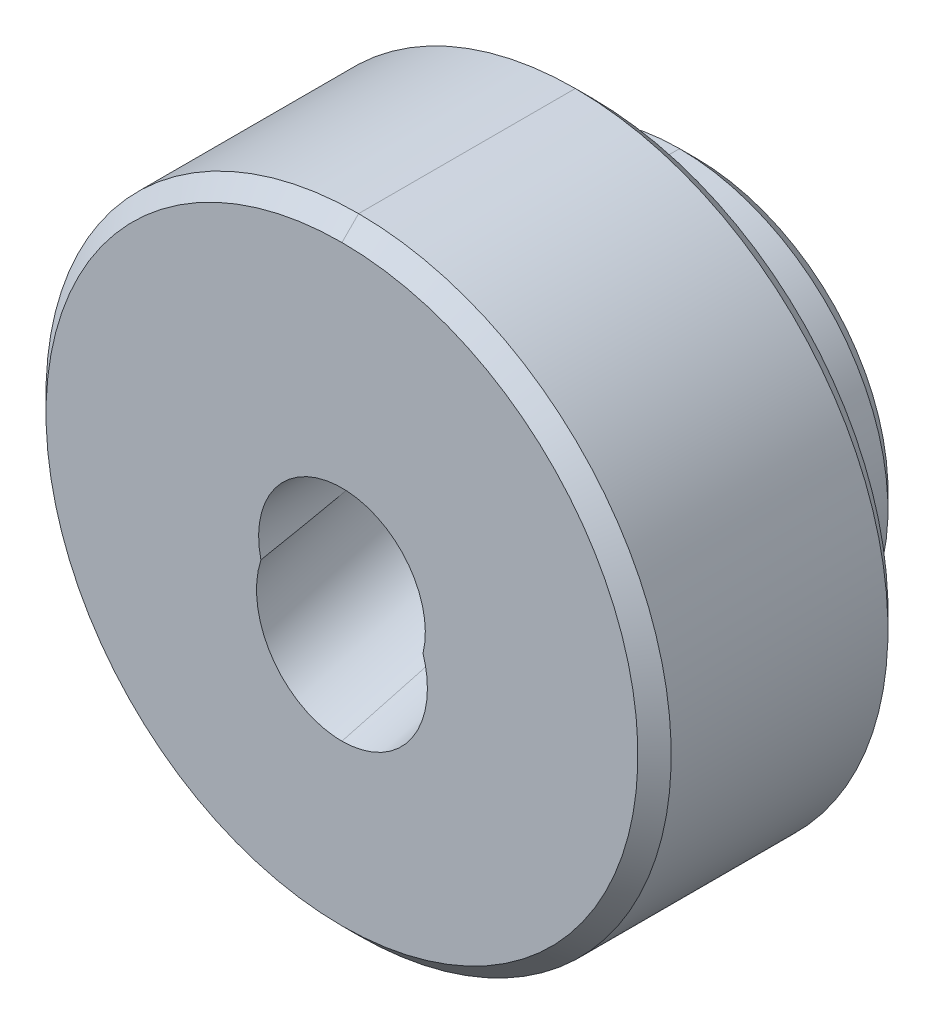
ISO-10303-21;
HEADER;
FILE_DESCRIPTION(('STEP AP214'),'2;1');
FILE_NAME('part.step','',(''),(''),'','','');
FILE_SCHEMA(('AUTOMOTIVE_DESIGN { 1 0 10303 214 1 1 1 1 }'));
ENDSEC;
DATA;
#1=APPLICATION_CONTEXT('core data for automotive mechanical design processes');
#2=APPLICATION_PROTOCOL_DEFINITION('international standard','automotive_design',2000,#1);
#3=PRODUCT_CONTEXT('',#1,'mechanical');
#4=PRODUCT('Part','Part','',(#3));
#5=PRODUCT_RELATED_PRODUCT_CATEGORY('part','',(#4));
#6=PRODUCT_DEFINITION_FORMATION('','',#4);
#7=PRODUCT_DEFINITION_CONTEXT('part definition',#1,'design');
#8=PRODUCT_DEFINITION('design','',#6,#7);
#9=PRODUCT_DEFINITION_SHAPE('','',#8);
#10=(LENGTH_UNIT() NAMED_UNIT(*) SI_UNIT(.MILLI.,.METRE.));
#11=(NAMED_UNIT(*) PLANE_ANGLE_UNIT() SI_UNIT($,.RADIAN.));
#12=(NAMED_UNIT(*) SI_UNIT($,.STERADIAN.) SOLID_ANGLE_UNIT());
#13=UNCERTAINTY_MEASURE_WITH_UNIT(LENGTH_MEASURE(1.E-05),#10,'distance_accuracy_value','');
#14=(GEOMETRIC_REPRESENTATION_CONTEXT(3) GLOBAL_UNCERTAINTY_ASSIGNED_CONTEXT((#13)) GLOBAL_UNIT_ASSIGNED_CONTEXT((#10,
#11,#12)) REPRESENTATION_CONTEXT('',''));
#15=CARTESIAN_POINT('',(0.,0.,0.));
#16=DIRECTION('',(0.,0.,1.));
#17=DIRECTION('',(1.,0.,0.));
#18=AXIS2_PLACEMENT_3D('',#15,#16,#17);
#19=CARTESIAN_POINT('',(0.,0.,4.2));
#20=DIRECTION('',(0.,0.,1.));
#21=DIRECTION('',(1.,0.,0.));
#22=AXIS2_PLACEMENT_3D('',#19,#20,#21);
#23=CYLINDRICAL_SURFACE('',#22,10.);
#24=CARTESIAN_POINT('',(0.,0.,4.2));
#25=DIRECTION('',(0.,0.,1.));
#26=DIRECTION('',(1.,0.,0.));
#27=AXIS2_PLACEMENT_3D('',#24,#25,#26);
#28=CIRCLE('',#27,10.);
#29=CARTESIAN_POINT('',(-10.,0.,4.2));
#30=VERTEX_POINT('',#29);
#31=CARTESIAN_POINT('',(0.,-10.,4.2));
#32=VERTEX_POINT('',#31);
#33=EDGE_CURVE('E409',#30,#32,#28,.T.);
#34=ORIENTED_EDGE('',*,*,#33,.F.);
#35=CARTESIAN_POINT('',(0.,0.,4.2));
#36=DIRECTION('',(0.,0.,1.));
#37=DIRECTION('',(1.,0.,0.));
#38=AXIS2_PLACEMENT_3D('',#35,#36,#37);
#39=CIRCLE('',#38,10.);
#40=CARTESIAN_POINT('',(0.,10.,4.2));
#41=VERTEX_POINT('',#40);
#42=EDGE_CURVE('E278',#41,#30,#39,.T.);
#43=ORIENTED_EDGE('',*,*,#42,.F.);
#44=DIRECTION('',(0.,0.,1.));
#45=VECTOR('',#44,1.);
#46=CARTESIAN_POINT('',(0.,10.,2.5));
#47=LINE('',#46,#45);
#48=CARTESIAN_POINT('',(0.,10.,0.8));
#49=VERTEX_POINT('',#48);
#50=EDGE_CURVE('E115',#49,#41,#47,.T.);
#51=ORIENTED_EDGE('',*,*,#50,.F.);
#52=CARTESIAN_POINT('',(0.,0.,0.8));
#53=DIRECTION('',(0.,0.,-1.));
#54=DIRECTION('',(0.,1.,0.));
#55=AXIS2_PLACEMENT_3D('',#52,#53,#54);
#56=CIRCLE('',#55,10.);
#57=CARTESIAN_POINT('',(0.,-10.,0.8));
#58=VERTEX_POINT('',#57);
#59=EDGE_CURVE('E184',#58,#49,#56,.T.);
#60=ORIENTED_EDGE('',*,*,#59,.F.);
#61=DIRECTION('',(0.,0.,-1.));
#62=VECTOR('',#61,1.);
#63=CARTESIAN_POINT('',(0.,-10.,2.5));
#64=LINE('',#63,#62);
#65=EDGE_CURVE('E411',#32,#58,#64,.T.);
#66=ORIENTED_EDGE('',*,*,#65,.F.);
#67=EDGE_LOOP('',(#34,#43,#51,#60,#66));
#68=FACE_BOUND('',#67,.T.);
#69=ADVANCED_FACE('F14',(#68),#23,.T.);
#70=CARTESIAN_POINT('',(0.,0.,4.2));
#71=DIRECTION('',(0.,0.,1.));
#72=DIRECTION('',(1.,0.,0.));
#73=AXIS2_PLACEMENT_3D('',#70,#71,#72);
#74=CYLINDRICAL_SURFACE('',#73,10.);
#75=ORIENTED_EDGE('',*,*,#65,.T.);
#76=CARTESIAN_POINT('',(0.,0.,0.8));
#77=DIRECTION('',(0.,0.,-1.));
#78=DIRECTION('',(0.,1.,0.));
#79=AXIS2_PLACEMENT_3D('',#76,#77,#78);
#80=CIRCLE('',#79,10.);
#81=EDGE_CURVE('E168',#49,#58,#80,.T.);
#82=ORIENTED_EDGE('',*,*,#81,.F.);
#83=ORIENTED_EDGE('',*,*,#50,.T.);
#84=CARTESIAN_POINT('',(0.,0.,4.2));
#85=DIRECTION('',(0.,0.,1.));
#86=DIRECTION('',(1.,0.,0.));
#87=AXIS2_PLACEMENT_3D('',#84,#85,#86);
#88=CIRCLE('',#87,10.);
#89=CARTESIAN_POINT('',(10.,0.,4.2));
#90=VERTEX_POINT('',#89);
#91=EDGE_CURVE('E276',#90,#41,#88,.T.);
#92=ORIENTED_EDGE('',*,*,#91,.F.);
#93=CARTESIAN_POINT('',(0.,0.,4.2));
#94=DIRECTION('',(0.,0.,1.));
#95=DIRECTION('',(1.,0.,0.));
#96=AXIS2_PLACEMENT_3D('',#93,#94,#95);
#97=CIRCLE('',#96,10.);
#98=EDGE_CURVE('E220',#32,#90,#97,.T.);
#99=ORIENTED_EDGE('',*,*,#98,.F.);
#100=EDGE_LOOP('',(#75,#82,#83,#92,#99));
#101=FACE_BOUND('',#100,.T.);
#102=ADVANCED_FACE('F403',(#101),#74,.T.);
#103=CARTESIAN_POINT('',(0.,0.,4.2));
#104=DIRECTION('',(0.,0.,1.));
#105=DIRECTION('',(1.,0.,0.));
#106=AXIS2_PLACEMENT_3D('',#103,#104,#105);
#107=TOROIDAL_SURFACE('',#106,10.8,0.8);
#108=CARTESIAN_POINT('',(10.8,0.,4.2));
#109=DIRECTION('',(0.,-1.,0.));
#110=DIRECTION('',(-1.,0.,0.));
#111=AXIS2_PLACEMENT_3D('',#108,#109,#110);
#112=CIRCLE('',#111,0.8);
#113=CARTESIAN_POINT('',(10.8,0.,5.));
#114=VERTEX_POINT('',#113);
#115=EDGE_CURVE('E219',#114,#90,#112,.T.);
#116=ORIENTED_EDGE('',*,*,#115,.F.);
#117=CARTESIAN_POINT('',(0.,0.,5.));
#118=DIRECTION('',(0.,0.,-1.));
#119=DIRECTION('',(1.,0.,0.));
#120=AXIS2_PLACEMENT_3D('',#117,#118,#119);
#121=CIRCLE('',#120,10.8);
#122=CARTESIAN_POINT('',(-10.8,0.,5.));
#123=VERTEX_POINT('',#122);
#124=EDGE_CURVE('E156',#123,#114,#121,.F.);
#125=ORIENTED_EDGE('',*,*,#124,.F.);
#126=CARTESIAN_POINT('',(-10.8,0.,4.2));
#127=DIRECTION('',(0.,1.,0.));
#128=DIRECTION('',(1.,0.,0.));
#129=AXIS2_PLACEMENT_3D('',#126,#127,#128);
#130=CIRCLE('',#129,0.8);
#131=EDGE_CURVE('E212',#30,#123,#130,.F.);
#132=ORIENTED_EDGE('',*,*,#131,.F.);
#133=ORIENTED_EDGE('',*,*,#33,.T.);
#134=ORIENTED_EDGE('',*,*,#98,.T.);
#135=EDGE_LOOP('',(#116,#125,#132,#133,#134));
#136=FACE_BOUND('',#135,.T.);
#137=ADVANCED_FACE('F197',(#136),#107,.F.);
#138=CARTESIAN_POINT('',(0.,0.,4.2));
#139=DIRECTION('',(0.,0.,1.));
#140=DIRECTION('',(1.,0.,0.));
#141=AXIS2_PLACEMENT_3D('',#138,#139,#140);
#142=TOROIDAL_SURFACE('',#141,10.8,0.8);
#143=ORIENTED_EDGE('',*,*,#91,.T.);
#144=ORIENTED_EDGE('',*,*,#42,.T.);
#145=ORIENTED_EDGE('',*,*,#131,.T.);
#146=CARTESIAN_POINT('',(0.,0.,5.));
#147=DIRECTION('',(0.,0.,-1.));
#148=DIRECTION('',(-1.,0.,0.));
#149=AXIS2_PLACEMENT_3D('',#146,#147,#148);
#150=CIRCLE('',#149,10.8);
#151=CARTESIAN_POINT('',(0.,10.8,5.));
#152=VERTEX_POINT('',#151);
#153=EDGE_CURVE('E162',#152,#123,#150,.F.);
#154=ORIENTED_EDGE('',*,*,#153,.F.);
#155=CARTESIAN_POINT('',(0.,0.,5.));
#156=DIRECTION('',(0.,0.,-1.));
#157=DIRECTION('',(0.,1.,0.));
#158=AXIS2_PLACEMENT_3D('',#155,#156,#157);
#159=CIRCLE('',#158,10.8);
#160=EDGE_CURVE('E151',#114,#152,#159,.F.);
#161=ORIENTED_EDGE('',*,*,#160,.F.);
#162=ORIENTED_EDGE('',*,*,#115,.T.);
#163=EDGE_LOOP('',(#143,#144,#145,#154,#161,#162));
#164=FACE_BOUND('',#163,.T.);
#165=ADVANCED_FACE('F191',(#164),#142,.F.);
#166=CARTESIAN_POINT('',(0.,0.,0.));
#167=DIRECTION('',(0.,0.,1.));
#168=DIRECTION('',(1.,0.,0.));
#169=AXIS2_PLACEMENT_3D('',#166,#167,#168);
#170=CONICAL_SURFACE('',#169,9.2,0.785398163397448);
#171=DIRECTION('',(0.,0.707106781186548,-0.707106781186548));
#172=VECTOR('',#171,1.);
#173=CARTESIAN_POINT('',(0.,-7.07106781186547,-2.12893218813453));
#174=LINE('',#173,#172);
#175=CARTESIAN_POINT('',(0.,-9.2,0.));
#176=VERTEX_POINT('',#175);
#177=EDGE_CURVE('E165',#58,#176,#174,.T.);
#178=ORIENTED_EDGE('',*,*,#177,.F.);
#179=ORIENTED_EDGE('',*,*,#59,.T.);
#180=DIRECTION('',(0.,0.707106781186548,0.707106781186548));
#181=VECTOR('',#180,1.);
#182=CARTESIAN_POINT('',(0.,7.07106781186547,-2.12893218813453));
#183=LINE('',#182,#181);
#184=CARTESIAN_POINT('',(0.,9.2,0.));
#185=VERTEX_POINT('',#184);
#186=EDGE_CURVE('E174',#185,#49,#183,.T.);
#187=ORIENTED_EDGE('',*,*,#186,.F.);
#188=CARTESIAN_POINT('',(0.,0.,0.));
#189=DIRECTION('',(0.,0.,1.));
#190=DIRECTION('',(1.,0.,0.));
#191=AXIS2_PLACEMENT_3D('',#188,#189,#190);
#192=CIRCLE('',#191,9.2);
#193=EDGE_CURVE('E148',#176,#185,#192,.F.);
#194=ORIENTED_EDGE('',*,*,#193,.F.);
#195=EDGE_LOOP('',(#178,#179,#187,#194));
#196=FACE_BOUND('',#195,.T.);
#197=ADVANCED_FACE('F196',(#196),#170,.T.);
#198=CARTESIAN_POINT('',(0.,0.,0.));
#199=DIRECTION('',(0.,0.,1.));
#200=DIRECTION('',(1.,0.,0.));
#201=AXIS2_PLACEMENT_3D('',#198,#199,#200);
#202=CONICAL_SURFACE('',#201,9.2,0.785398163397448);
#203=ORIENTED_EDGE('',*,*,#177,.T.);
#204=CARTESIAN_POINT('',(0.,0.,0.));
#205=DIRECTION('',(0.,0.,1.));
#206=DIRECTION('',(1.,0.,0.));
#207=AXIS2_PLACEMENT_3D('',#204,#205,#206);
#208=CIRCLE('',#207,9.2);
#209=EDGE_CURVE('E145',#185,#176,#208,.F.);
#210=ORIENTED_EDGE('',*,*,#209,.F.);
#211=ORIENTED_EDGE('',*,*,#186,.T.);
#212=ORIENTED_EDGE('',*,*,#81,.T.);
#213=EDGE_LOOP('',(#203,#210,#211,#212));
#214=FACE_BOUND('',#213,.T.);
#215=ADVANCED_FACE('F238',(#214),#202,.T.);
#216=CARTESIAN_POINT('',(14.3704021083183,14.2,5.));
#217=DIRECTION('',(0.,0.,-1.));
#218=DIRECTION('',(0.,-1.,0.));
#219=AXIS2_PLACEMENT_3D('',#216,#217,#218);
#220=PLANE('',#219);
#221=ORIENTED_EDGE('',*,*,#124,.T.);
#222=ORIENTED_EDGE('',*,*,#160,.T.);
#223=ORIENTED_EDGE('',*,*,#153,.T.);
#224=EDGE_LOOP('',(#221,#222,#223));
#225=FACE_BOUND('',#224,.T.);
#226=CARTESIAN_POINT('',(0.,0.,5.));
#227=DIRECTION('',(0.,0.,1.));
#228=DIRECTION('',(1.,0.,0.));
#229=AXIS2_PLACEMENT_3D('',#226,#227,#228);
#230=CIRCLE('',#229,14.2);
#231=CARTESIAN_POINT('',(0.,14.2,5.));
#232=VERTEX_POINT('',#231);
#233=CARTESIAN_POINT('',(0.,-14.2,5.));
#234=VERTEX_POINT('',#233);
#235=EDGE_CURVE('E140',#232,#234,#230,.T.);
#236=ORIENTED_EDGE('',*,*,#235,.F.);
#237=CARTESIAN_POINT('',(0.,0.,5.));
#238=DIRECTION('',(0.,0.,1.));
#239=DIRECTION('',(1.,0.,0.));
#240=AXIS2_PLACEMENT_3D('',#237,#238,#239);
#241=CIRCLE('',#240,14.2);
#242=EDGE_CURVE('E150',#234,#232,#241,.T.);
#243=ORIENTED_EDGE('',*,*,#242,.F.);
#244=EDGE_LOOP('',(#236,#243));
#245=FACE_BOUND('',#244,.T.);
#246=ADVANCED_FACE('F228',(#225,#245),#220,.T.);
#247=CARTESIAN_POINT('',(0.,0.,5.));
#248=DIRECTION('',(0.,0.,1.));
#249=DIRECTION('',(1.,0.,0.));
#250=AXIS2_PLACEMENT_3D('',#247,#248,#249);
#251=CONICAL_SURFACE('',#250,14.2,0.785398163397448);
#252=DIRECTION('',(0.,-0.707106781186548,0.707106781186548));
#253=VECTOR('',#252,1.);
#254=CARTESIAN_POINT('',(0.,-10.6066017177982,1.40660171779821));
#255=LINE('',#254,#253);
#256=CARTESIAN_POINT('',(0.,-15.,5.8));
#257=VERTEX_POINT('',#256);
#258=EDGE_CURVE('E143',#234,#257,#255,.T.);
#259=ORIENTED_EDGE('',*,*,#258,.F.);
#260=ORIENTED_EDGE('',*,*,#242,.T.);
#261=DIRECTION('',(0.,-0.707106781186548,-0.707106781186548));
#262=VECTOR('',#261,1.);
#263=CARTESIAN_POINT('',(0.,10.6066017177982,1.40660171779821));
#264=LINE('',#263,#262);
#265=CARTESIAN_POINT('',(0.,15.,5.8));
#266=VERTEX_POINT('',#265);
#267=EDGE_CURVE('E144',#266,#232,#264,.T.);
#268=ORIENTED_EDGE('',*,*,#267,.F.);
#269=CARTESIAN_POINT('',(0.,0.,5.8));
#270=DIRECTION('',(0.,0.,1.));
#271=DIRECTION('',(0.,1.,0.));
#272=AXIS2_PLACEMENT_3D('',#269,#270,#271);
#273=CIRCLE('',#272,15.);
#274=EDGE_CURVE('E327',#257,#266,#273,.T.);
#275=ORIENTED_EDGE('',*,*,#274,.F.);
#276=EDGE_LOOP('',(#259,#260,#268,#275));
#277=FACE_BOUND('',#276,.T.);
#278=ADVANCED_FACE('F237',(#277),#251,.T.);
#279=CARTESIAN_POINT('',(9.31040210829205,9.2,0.));
#280=DIRECTION('',(0.,0.,-1.));
#281=DIRECTION('',(0.,-1.,0.));
#282=AXIS2_PLACEMENT_3D('',#279,#280,#281);
#283=PLANE('',#282);
#284=CARTESIAN_POINT('',(0.,0.,0.));
#285=DIRECTION('',(0.,0.,-1.));
#286=DIRECTION('',(-1.,0.,0.));
#287=AXIS2_PLACEMENT_3D('',#284,#285,#286);
#288=CIRCLE('',#287,4.);
#289=CARTESIAN_POINT('',(3.88932314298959,0.934433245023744,0.));
#290=VERTEX_POINT('',#289);
#291=CARTESIAN_POINT('',(-3.88932314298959,0.934433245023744,0.));
#292=VERTEX_POINT('',#291);
#293=EDGE_CURVE('E28',#290,#292,#288,.T.);
#294=ORIENTED_EDGE('',*,*,#293,.F.);
#295=CARTESIAN_POINT('',(0.,2.27756813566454,0.));
#296=DIRECTION('',(0.,0.,-1.));
#297=DIRECTION('',(0.,-1.,0.));
#298=AXIS2_PLACEMENT_3D('',#295,#296,#297);
#299=ELLIPSE('',#298,4.24463233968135,4.1);
#300=CARTESIAN_POINT('',(0.,6.52220047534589,0.));
#301=VERTEX_POINT('',#300);
#302=EDGE_CURVE('E122',#301,#290,#299,.T.);
#303=ORIENTED_EDGE('',*,*,#302,.F.);
#304=CARTESIAN_POINT('',(0.,2.27756813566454,0.));
#305=DIRECTION('',(0.,0.,-1.));
#306=DIRECTION('',(0.,-1.,0.));
#307=AXIS2_PLACEMENT_3D('',#304,#305,#306);
#308=ELLIPSE('',#307,4.24463233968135,4.1);
#309=EDGE_CURVE('E124',#292,#301,#308,.T.);
#310=ORIENTED_EDGE('',*,*,#309,.F.);
#311=EDGE_LOOP('',(#294,#303,#310));
#312=FACE_BOUND('',#311,.T.);
#313=ORIENTED_EDGE('',*,*,#193,.T.);
#314=ORIENTED_EDGE('',*,*,#209,.T.);
#315=EDGE_LOOP('',(#313,#314));
#316=FACE_BOUND('',#315,.T.);
#317=ADVANCED_FACE('F120',(#312,#316),#283,.T.);
#318=CARTESIAN_POINT('',(0.,0.,5.));
#319=DIRECTION('',(0.,0.,1.));
#320=DIRECTION('',(1.,0.,0.));
#321=AXIS2_PLACEMENT_3D('',#318,#319,#320);
#322=CONICAL_SURFACE('',#321,14.2,0.785398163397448);
#323=ORIENTED_EDGE('',*,*,#258,.T.);
#324=CARTESIAN_POINT('',(0.,0.,5.8));
#325=DIRECTION('',(0.,0.,1.));
#326=DIRECTION('',(0.,1.,0.));
#327=AXIS2_PLACEMENT_3D('',#324,#325,#326);
#328=CIRCLE('',#327,15.);
#329=EDGE_CURVE('E303',#266,#257,#328,.T.);
#330=ORIENTED_EDGE('',*,*,#329,.F.);
#331=ORIENTED_EDGE('',*,*,#267,.T.);
#332=ORIENTED_EDGE('',*,*,#235,.T.);
#333=EDGE_LOOP('',(#323,#330,#331,#332));
#334=FACE_BOUND('',#333,.T.);
#335=ADVANCED_FACE('F429',(#334),#322,.T.);
#336=CARTESIAN_POINT('',(0.,0.,16.2));
#337=DIRECTION('',(0.,0.,1.));
#338=DIRECTION('',(1.,0.,0.));
#339=AXIS2_PLACEMENT_3D('',#336,#337,#338);
#340=CYLINDRICAL_SURFACE('',#339,15.);
#341=DIRECTION('',(0.,0.,1.));
#342=VECTOR('',#341,1.);
#343=CARTESIAN_POINT('',(0.,-15.,11.));
#344=LINE('',#343,#342);
#345=CARTESIAN_POINT('',(0.,-15.,16.2));
#346=VERTEX_POINT('',#345);
#347=EDGE_CURVE('E298',#257,#346,#344,.T.);
#348=ORIENTED_EDGE('',*,*,#347,.F.);
#349=ORIENTED_EDGE('',*,*,#274,.T.);
#350=DIRECTION('',(0.,0.,-1.));
#351=VECTOR('',#350,1.);
#352=CARTESIAN_POINT('',(0.,15.,11.));
#353=LINE('',#352,#351);
#354=CARTESIAN_POINT('',(0.,15.,16.2));
#355=VERTEX_POINT('',#354);
#356=EDGE_CURVE('E310',#355,#266,#353,.T.);
#357=ORIENTED_EDGE('',*,*,#356,.F.);
#358=CARTESIAN_POINT('',(0.,0.,16.2));
#359=DIRECTION('',(0.,0.,1.));
#360=DIRECTION('',(0.,1.,0.));
#361=AXIS2_PLACEMENT_3D('',#358,#359,#360);
#362=CIRCLE('',#361,15.);
#363=EDGE_CURVE('E130',#346,#355,#362,.T.);
#364=ORIENTED_EDGE('',*,*,#363,.F.);
#365=EDGE_LOOP('',(#348,#349,#357,#364));
#366=FACE_BOUND('',#365,.T.);
#367=ADVANCED_FACE('F349',(#366),#340,.T.);
#368=CARTESIAN_POINT('',(0.,0.,17.));
#369=DIRECTION('',(0.,0.,-1.));
#370=DIRECTION('',(-1.,0.,0.));
#371=AXIS2_PLACEMENT_3D('',#368,#369,#370);
#372=CONICAL_SURFACE('',#371,14.2,0.785398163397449);
#373=DIRECTION('',(0.,-0.707106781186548,-0.707106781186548));
#374=VECTOR('',#373,1.);
#375=CARTESIAN_POINT('',(0.,-10.6066017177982,20.5933982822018));
#376=LINE('',#375,#374);
#377=CARTESIAN_POINT('',(0.,-14.2,17.));
#378=VERTEX_POINT('',#377);
#379=EDGE_CURVE('E135',#378,#346,#376,.T.);
#380=ORIENTED_EDGE('',*,*,#379,.T.);
#381=ORIENTED_EDGE('',*,*,#363,.T.);
#382=DIRECTION('',(0.,-0.707106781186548,0.707106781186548));
#383=VECTOR('',#382,1.);
#384=CARTESIAN_POINT('',(0.,10.6066017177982,20.5933982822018));
#385=LINE('',#384,#383);
#386=CARTESIAN_POINT('',(0.,14.2,17.));
#387=VERTEX_POINT('',#386);
#388=EDGE_CURVE('E330',#355,#387,#385,.T.);
#389=ORIENTED_EDGE('',*,*,#388,.T.);
#390=CARTESIAN_POINT('',(0.,0.,17.));
#391=DIRECTION('',(0.,0.,-1.));
#392=DIRECTION('',(-1.,0.,0.));
#393=AXIS2_PLACEMENT_3D('',#390,#391,#392);
#394=CIRCLE('',#393,14.2);
#395=EDGE_CURVE('E296',#378,#387,#394,.F.);
#396=ORIENTED_EDGE('',*,*,#395,.F.);
#397=EDGE_LOOP('',(#380,#381,#389,#396));
#398=FACE_BOUND('',#397,.T.);
#399=ADVANCED_FACE('F350',(#398),#372,.T.);
#400=CARTESIAN_POINT('',(0.,2.56197886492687,-1.06143529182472));
#401=DIRECTION('',(0.,-0.258819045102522,0.965925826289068));
#402=DIRECTION('',(0.,-0.965925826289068,-0.258819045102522));
#403=AXIS2_PLACEMENT_3D('',#400,#401,#402);
#404=CYLINDRICAL_SURFACE('',#403,4.1);
#405=CARTESIAN_POINT('',(0.,4.,9.41298032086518));
#406=CARTESIAN_POINT('',(0.112520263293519,4.00001215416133,9.41298761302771));
#407=CARTESIAN_POINT('',(0.225038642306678,3.99525270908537,9.41280299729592));
#408=CARTESIAN_POINT('',(0.449268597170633,3.9762784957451,9.41210169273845));
#409=CARTESIAN_POINT('',(0.560980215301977,3.96206422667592,9.41158502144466));
#410=CARTESIAN_POINT('',(0.782665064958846,3.92429217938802,9.41027217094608));
#411=CARTESIAN_POINT('',(0.892640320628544,3.90074626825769,9.40947634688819));
#412=CARTESIAN_POINT('',(1.11021576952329,3.84448242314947,9.40771168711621));
#413=CARTESIAN_POINT('',(1.21781599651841,3.81176461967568,9.40674285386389));
#414=CARTESIAN_POINT('',(1.4299157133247,3.73737551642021,9.40478679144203));
#415=CARTESIAN_POINT('',(1.53441416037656,3.69570124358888,9.40379955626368));
#416=CARTESIAN_POINT('',(1.73953475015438,3.60370000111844,9.40202572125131));
#417=CARTESIAN_POINT('',(1.84015680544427,3.55337283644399,9.40123912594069));
#418=CARTESIAN_POINT('',(2.03687487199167,3.44438576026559,9.40016572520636));
#419=CARTESIAN_POINT('',(2.13296777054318,3.38572022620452,9.39987925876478));
#420=CARTESIAN_POINT('',(2.31986350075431,3.26050378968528,9.40021673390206));
#421=CARTESIAN_POINT('',(2.41066659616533,3.19395328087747,9.40084063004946));
#422=CARTESIAN_POINT('',(2.58635234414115,3.05343030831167,9.40356242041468));
#423=CARTESIAN_POINT('',(2.67123356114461,2.97945605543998,9.4056606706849));
#424=CARTESIAN_POINT('',(2.83441283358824,2.82466814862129,9.41211944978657));
#425=CARTESIAN_POINT('',(2.91271140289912,2.74385502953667,9.41647980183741));
#426=CARTESIAN_POINT('',(3.06203874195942,2.57614128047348,9.42858061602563));
#427=CARTESIAN_POINT('',(3.13307539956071,2.48924743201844,9.43631736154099));
#428=CARTESIAN_POINT('',(3.26730676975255,2.31024296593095,9.4567943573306));
#429=CARTESIAN_POINT('',(3.3305069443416,2.21813604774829,9.46953109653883));
#430=CARTESIAN_POINT('',(3.45419265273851,2.02072646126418,9.50397635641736));
#431=CARTESIAN_POINT('',(3.51383199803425,1.91500680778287,9.52643016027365));
#432=CARTESIAN_POINT('',(3.59491688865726,1.75503870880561,9.57013240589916));
#433=CARTESIAN_POINT('',(3.6205373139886,1.70151537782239,9.58635801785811));
#434=CARTESIAN_POINT('',(3.66890403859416,1.59454966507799,9.6228336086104));
#435=CARTESIAN_POINT('',(3.69165096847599,1.54110726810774,9.64308270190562));
#436=CARTESIAN_POINT('',(3.74734698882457,1.40210957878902,9.70231561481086));
#437=CARTESIAN_POINT('',(3.7778988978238,1.31714696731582,9.74513877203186));
#438=CARTESIAN_POINT('',(3.83104698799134,1.15346882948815,9.84491277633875));
#439=CARTESIAN_POINT('',(3.853663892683,1.07473745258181,9.90182615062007));
#440=CARTESIAN_POINT('',(3.89186937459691,0.926940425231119,10.0287922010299));
#441=CARTESIAN_POINT('',(3.90746444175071,0.857865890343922,10.0988326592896));
#442=CARTESIAN_POINT('',(3.93332962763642,0.730198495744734,10.2488865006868));
#443=CARTESIAN_POINT('',(3.94358478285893,0.671635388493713,10.3289271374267));
#444=CARTESIAN_POINT('',(3.96198629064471,0.553947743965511,10.5107707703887));
#445=CARTESIAN_POINT('',(3.9693880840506,0.496736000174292,10.613855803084));
#446=CARTESIAN_POINT('',(3.98107279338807,0.392180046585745,10.8251598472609));
#447=CARTESIAN_POINT('',(3.98534933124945,0.344856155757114,10.9333888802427));
#448=CARTESIAN_POINT('',(3.99200249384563,0.256690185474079,11.1543624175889));
#449=CARTESIAN_POINT('',(3.99434924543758,0.215957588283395,11.267150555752));
#450=CARTESIAN_POINT('',(3.9977369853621,0.139791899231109,11.4943672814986));
#451=CARTESIAN_POINT('',(3.99877920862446,0.104353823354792,11.6087942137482));
#452=CARTESIAN_POINT('',(4.0000321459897,0.0335973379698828,11.8514109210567));
#453=CARTESIAN_POINT('',(4.00013867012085,-0.00127826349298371,11.9797288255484));
#454=CARTESIAN_POINT('',(3.99956445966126,-0.0676407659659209,12.2372423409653));
#455=CARTESIAN_POINT('',(3.99888361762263,-0.0991272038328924,12.3664380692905));
#456=CARTESIAN_POINT('',(3.99595332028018,-0.189904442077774,12.7550025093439));
#457=CARTESIAN_POINT('',(3.99281589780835,-0.245479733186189,13.0152265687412));
#458=CARTESIAN_POINT('',(3.98491690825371,-0.350992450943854,13.5374008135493));
#459=CARTESIAN_POINT('',(3.98015146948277,-0.40091605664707,13.7993536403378));
#460=CARTESIAN_POINT('',(3.96929457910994,-0.497030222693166,14.3238350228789));
#461=CARTESIAN_POINT('',(3.96320350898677,-0.543221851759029,14.5863633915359));
#462=CARTESIAN_POINT('',(3.95054907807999,-0.628334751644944,15.0839414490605));
#463=CARTESIAN_POINT('',(3.94410437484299,-0.667507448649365,15.3189516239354));
#464=CARTESIAN_POINT('',(3.93031945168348,-0.744388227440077,15.7892058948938));
#465=CARTESIAN_POINT('',(3.92297915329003,-0.782096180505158,16.0244500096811));
#466=CARTESIAN_POINT('',(3.90746257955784,-0.856251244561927,16.4940617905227));
#467=CARTESIAN_POINT('',(3.89929006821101,-0.89270311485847,16.7284288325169));
#468=CARTESIAN_POINT('',(3.88209032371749,-0.964746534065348,17.1972385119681));
#469=CARTESIAN_POINT('',(3.87306318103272,-1.0003381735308,17.4316811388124));
#470=CARTESIAN_POINT('',(3.86361158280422,-1.0356184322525,17.6661526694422));
#471=B_SPLINE_CURVE_WITH_KNOTS('',3,(#405,#406,#407,#408,#409,#410,#411,#412,#413,#414,#415,
#416,#417,#418,#419,#420,#421,#422,#423,#424,#425,#426,#427,#428,#429,#430,#431,#432,#433,#434,
#435,#436,#437,#438,#439,#440,#441,#442,#443,#444,#445,#446,#447,#448,#449,#450,#451,#452,#453,
#454,#455,#456,#457,#458,#459,#460,#461,#462,#463,#464,#465,#466,#467,#468,#469,#470),
.UNSPECIFIED.,.F.,.F.,(4,2,2,2,2,2,2,2,2,2,2,2,2,2,2,2,2,2,2,2,2,2,2,2,2,2,2,2,2,2,2,2,4),(0.,
0.33745734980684,0.674896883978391,1.01190866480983,1.34891565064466,1.68603467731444,
2.02316130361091,2.36051634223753,2.69785454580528,3.03527424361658,3.3726675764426,
3.7096904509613,4.04647708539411,4.41566616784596,4.60005129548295,4.78439588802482,
5.08281469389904,5.38044822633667,5.67780610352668,5.97599281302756,6.32951805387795,
6.68376277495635,7.04339313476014,7.40268279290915,7.80153260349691,8.20043684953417,
8.99862424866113,9.79872323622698,10.5985922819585,11.3136047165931,12.0286798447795,
12.7406534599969,13.4525517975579),.UNSPECIFIED.);
#472=CARTESIAN_POINT('',(0.,4.,9.41298032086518));
#473=VERTEX_POINT('',#472);
#474=CARTESIAN_POINT('',(3.88932314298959,-0.93443324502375,17.));
#475=VERTEX_POINT('',#474);
#476=EDGE_CURVE('E35',#473,#475,#471,.T.);
#477=ORIENTED_EDGE('',*,*,#476,.F.);
#478=DIRECTION('',(0.,-0.258819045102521,0.965925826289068));
#479=VECTOR('',#478,1.);
#480=CARTESIAN_POINT('',(0.,3.96029588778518,9.56115808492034));
#481=LINE('',#480,#479);
#482=EDGE_CURVE('E129',#301,#473,#481,.T.);
#483=ORIENTED_EDGE('',*,*,#482,.F.);
#484=ORIENTED_EDGE('',*,*,#302,.T.);
#485=CARTESIAN_POINT('',(0.,-4.,7.58701967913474));
#486=CARTESIAN_POINT('',(0.112520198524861,-4.00001215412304,7.58701238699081));
#487=CARTESIAN_POINT('',(0.225038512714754,-3.99525271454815,7.58719700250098));
#488=CARTESIAN_POINT('',(0.449268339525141,-3.97627852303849,7.58789830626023));
#489=CARTESIAN_POINT('',(0.560979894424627,-3.9620642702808,7.58841497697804));
#490=CARTESIAN_POINT('',(0.782664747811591,-3.92429224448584,7.58972782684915));
#491=CARTESIAN_POINT('',(0.892640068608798,-3.90074632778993,7.59052365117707));
#492=CARTESIAN_POINT('',(1.11021564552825,-3.84448246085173,7.59228831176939));
#493=CARTESIAN_POINT('',(1.21781593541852,-3.8117646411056,7.59325714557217));
#494=CARTESIAN_POINT('',(1.42991580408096,-3.73737548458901,7.59521320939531));
#495=CARTESIAN_POINT('',(1.53441433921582,-3.69570117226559,7.59620044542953));
#496=CARTESIAN_POINT('',(1.73953509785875,-3.6036998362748,7.59797428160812));
#497=CARTESIAN_POINT('',(1.84015723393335,-3.55337261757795,7.59876087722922));
#498=CARTESIAN_POINT('',(2.03687528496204,-3.4443855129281,7.59983427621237));
#499=CARTESIAN_POINT('',(2.13296809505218,-3.3857200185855,7.600120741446));
#500=CARTESIAN_POINT('',(2.31986365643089,-3.26050367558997,7.59978326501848));
#501=CARTESIAN_POINT('',(2.41066667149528,-3.19395322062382,7.59915936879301));
#502=CARTESIAN_POINT('',(2.58635208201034,-3.05343051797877,7.59643758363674));
#503=CARTESIAN_POINT('',(2.67123305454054,-2.97945649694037,7.59433934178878));
#504=CARTESIAN_POINT('',(2.83441187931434,-2.82466909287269,7.58788059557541));
#505=CARTESIAN_POINT('',(2.91271024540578,-2.74385624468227,7.58352026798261));
#506=CARTESIAN_POINT('',(3.06203767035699,-2.57614256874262,7.57141949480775));
#507=CARTESIAN_POINT('',(3.1330745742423,-2.48924848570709,7.56368274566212));
#508=CARTESIAN_POINT('',(3.26730639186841,-2.31024351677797,7.54320571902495));
#509=CARTESIAN_POINT('',(3.33050676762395,-2.21813633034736,7.53046895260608));
#510=CARTESIAN_POINT('',(3.45419318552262,-2.02072561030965,7.49602349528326));
#511=CARTESIAN_POINT('',(3.51383298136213,-1.91500506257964,7.4735694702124));
#512=CARTESIAN_POINT('',(3.59491795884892,-1.75503649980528,7.42986693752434));
#513=CARTESIAN_POINT('',(3.62053813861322,-1.70151360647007,7.41364141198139));
#514=CARTESIAN_POINT('',(3.6689044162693,-1.59454877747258,7.37716605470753));
#515=CARTESIAN_POINT('',(3.69165114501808,-1.54110682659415,7.35691710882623));
#516=CARTESIAN_POINT('',(3.74734638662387,-1.40211108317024,7.29768502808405));
#517=CARTESIAN_POINT('',(3.77789782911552,-1.31714994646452,7.25486273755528));
#518=CARTESIAN_POINT('',(3.8310461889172,-1.15347160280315,7.15508921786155));
#519=CARTESIAN_POINT('',(3.85366355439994,-1.07473875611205,7.09817496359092));
#520=CARTESIAN_POINT('',(3.89186971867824,-0.926939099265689,6.97120666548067));
#521=CARTESIAN_POINT('',(3.90746500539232,-0.857863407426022,6.9011648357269));
#522=CARTESIAN_POINT('',(3.93332998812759,-0.730196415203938,6.75111063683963));
#523=CARTESIAN_POINT('',(3.94358491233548,-0.67163448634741,6.67107136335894));
#524=CARTESIAN_POINT('',(3.96198803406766,-0.553936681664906,6.48921226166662));
#525=CARTESIAN_POINT('',(3.9693907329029,-0.496716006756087,6.38610876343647));
#526=CARTESIAN_POINT('',(3.98107626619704,-0.392145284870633,6.17476490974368));
#527=CARTESIAN_POINT('',(3.98535267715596,-0.344815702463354,6.06651446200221));
#528=CARTESIAN_POINT('',(3.99200503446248,-0.256652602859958,5.8455385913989));
#529=CARTESIAN_POINT('',(3.99435184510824,-0.215925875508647,5.73277060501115));
#530=CARTESIAN_POINT('',(3.99773618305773,-0.139783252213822,5.50559117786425));
#531=CARTESIAN_POINT('',(3.99877494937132,-0.10436235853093,5.39118139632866));
#532=CARTESIAN_POINT('',(4.00054662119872,-0.00499892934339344,5.05063337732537));
#533=CARTESIAN_POINT('',(4.00002288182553,0.053582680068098,4.82294334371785));
#534=CARTESIAN_POINT('',(3.99705565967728,0.162599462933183,4.36560940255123));
#535=CARTESIAN_POINT('',(3.99461121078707,0.213030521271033,4.13596456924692));
#536=CARTESIAN_POINT('',(3.98834662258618,0.308873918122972,3.67515763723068));
#537=CARTESIAN_POINT('',(3.98452364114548,0.354275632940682,3.44399337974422));
#538=CARTESIAN_POINT('',(3.97577997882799,0.441693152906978,2.98111023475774));
#539=CARTESIAN_POINT('',(3.97085954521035,0.483709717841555,2.74939148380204));
#540=CARTESIAN_POINT('',(3.96056840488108,0.561501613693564,2.30770250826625));
#541=CARTESIAN_POINT('',(3.9552855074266,0.597489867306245,2.09776754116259));
#542=CARTESIAN_POINT('',(3.94398180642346,0.668043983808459,1.677664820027));
#543=CARTESIAN_POINT('',(3.93796095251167,0.702609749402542,1.46749705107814));
#544=CARTESIAN_POINT('',(3.92523605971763,0.770527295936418,1.04782572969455));
#545=CARTESIAN_POINT('',(3.91853476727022,0.803883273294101,0.838322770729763));
#546=CARTESIAN_POINT('',(3.9044428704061,0.869741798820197,0.419224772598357));
#547=CARTESIAN_POINT('',(3.89705232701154,0.902244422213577,0.209629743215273));
#548=CARTESIAN_POINT('',(3.88932314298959,0.934433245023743,0.));
#549=B_SPLINE_CURVE_WITH_KNOTS('',3,(#485,#486,#487,#488,#489,#490,#491,#492,#493,#494,#495,
#496,#497,#498,#499,#500,#501,#502,#503,#504,#505,#506,#507,#508,#509,#510,#511,#512,#513,#514,
#515,#516,#517,#518,#519,#520,#521,#522,#523,#524,#525,#526,#527,#528,#529,#530,#531,#532,#533,
#534,#535,#536,#537,#538,#539,#540,#541,#542,#543,#544,#545,#546,#547,#548),.UNSPECIFIED.,.F.,
.F.,(4,2,2,2,2,2,2,2,2,2,2,2,2,2,2,2,2,2,2,2,2,2,2,2,2,2,2,2,2,2,2,4),(0.,0.337457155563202,
0.674896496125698,1.01190847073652,1.34891565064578,1.68603496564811,2.02316188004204,
2.36051663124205,2.69785454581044,3.03527323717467,3.37266556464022,3.70968944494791,
4.04647708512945,4.4156692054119,4.60005282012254,4.7843958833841,5.08280947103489,
5.38044821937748,5.67781140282,5.97599280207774,6.32957892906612,6.68388953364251,
7.0434565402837,7.40268269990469,8.10765379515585,8.81297971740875,9.51976820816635,
10.2263976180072,10.8655781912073,11.5048024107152,12.1415420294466,12.7782253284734),.UNSPECIFIED.);
#550=CARTESIAN_POINT('',(0.,-4.,7.58701967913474));
#551=VERTEX_POINT('',#550);
#552=EDGE_CURVE('E108',#551,#290,#549,.T.);
#553=ORIENTED_EDGE('',*,*,#552,.F.);
#554=DIRECTION('',(0.,0.258819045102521,-0.965925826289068));
#555=VECTOR('',#554,1.);
#556=CARTESIAN_POINT('',(0.,-3.96029588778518,7.43884191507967));
#557=LINE('',#556,#555);
#558=CARTESIAN_POINT('',(0.,-6.52220047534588,17.));
#559=VERTEX_POINT('',#558);
#560=EDGE_CURVE('E132',#559,#551,#557,.T.);
#561=ORIENTED_EDGE('',*,*,#560,.F.);
#562=CARTESIAN_POINT('',(0.,-2.27756813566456,17.));
#563=DIRECTION('',(0.,0.,1.));
#564=DIRECTION('',(0.,-1.,0.));
#565=AXIS2_PLACEMENT_3D('',#562,#563,#564);
#566=ELLIPSE('',#565,4.24463233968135,4.1);
#567=EDGE_CURVE('E295',#475,#559,#566,.F.);
#568=ORIENTED_EDGE('',*,*,#567,.F.);
#569=EDGE_LOOP('',(#477,#483,#484,#553,#561,#568));
#570=FACE_BOUND('',#569,.T.);
#571=ADVANCED_FACE('F127',(#570),#404,.F.);
#572=CARTESIAN_POINT('',(0.,2.56197886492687,-1.06143529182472));
#573=DIRECTION('',(0.,-0.258819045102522,0.965925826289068));
#574=DIRECTION('',(0.,-0.965925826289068,-0.258819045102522));
#575=AXIS2_PLACEMENT_3D('',#572,#573,#574);
#576=CYLINDRICAL_SURFACE('',#575,4.1);
#577=CARTESIAN_POINT('',(-3.86361158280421,-1.0356184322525,17.6661526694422));
#578=CARTESIAN_POINT('',(-3.87322191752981,-0.999746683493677,17.4277461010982));
#579=CARTESIAN_POINT('',(-3.88239322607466,-0.963552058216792,17.1893698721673));
#580=CARTESIAN_POINT('',(-3.89985172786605,-0.890271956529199,16.7127114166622));
#581=CARTESIAN_POINT('',(-3.90813888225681,-0.853186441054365,16.4744291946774));
#582=CARTESIAN_POINT('',(-3.92382917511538,-0.777848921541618,15.9978001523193));
#583=CARTESIAN_POINT('',(-3.93123151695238,-0.73959590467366,15.759453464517));
#584=CARTESIAN_POINT('',(-3.94511271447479,-0.661547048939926,15.2829942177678));
#585=CARTESIAN_POINT('',(-3.95159159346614,-0.621751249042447,15.0448816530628));
#586=CARTESIAN_POINT('',(-3.9678580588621,-0.511056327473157,14.3994866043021));
#587=CARTESIAN_POINT('',(-3.97671562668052,-0.438191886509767,13.9925047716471));
#588=CARTESIAN_POINT('',(-3.98734909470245,-0.320280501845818,13.3836369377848));
#589=CARTESIAN_POINT('',(-3.9904514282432,-0.279541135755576,13.1809494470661));
#590=CARTESIAN_POINT('',(-3.99553550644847,-0.193758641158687,12.7764991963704));
#591=CARTESIAN_POINT('',(-3.9975174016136,-0.148716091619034,12.57473631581));
#592=CARTESIAN_POINT('',(-4.00010052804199,-0.0466152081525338,12.149699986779));
#593=CARTESIAN_POINT('',(-4.00051797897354,0.0112281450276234,11.9266048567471));
#594=CARTESIAN_POINT('',(-3.99865317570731,0.108634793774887,11.5949597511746));
#595=CARTESIAN_POINT('',(-3.99761552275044,0.142892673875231,11.4848687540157));
#596=CARTESIAN_POINT('',(-3.9943166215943,0.216301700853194,11.266385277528));
#597=CARTESIAN_POINT('',(-3.99205578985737,0.255451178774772,11.1579922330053));
#598=CARTESIAN_POINT('',(-3.98504330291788,0.349523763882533,10.9210932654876));
#599=CARTESIAN_POINT('',(-3.97986530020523,0.406031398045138,10.7931934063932));
#600=CARTESIAN_POINT('',(-3.96853692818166,0.501711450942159,10.6072528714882));
#601=CARTESIAN_POINT('',(-3.96417200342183,0.535394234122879,10.5463025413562));
#602=CARTESIAN_POINT('',(-3.95382856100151,0.60708861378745,10.4271666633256));
#603=CARTESIAN_POINT('',(-3.94785076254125,0.645098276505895,10.3689798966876));
#604=CARTESIAN_POINT('',(-3.93054946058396,0.744568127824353,10.2306814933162));
#605=CARTESIAN_POINT('',(-3.91803126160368,0.808823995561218,10.1526550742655));
#606=CARTESIAN_POINT('',(-3.88663087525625,0.948232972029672,10.0086875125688));
#607=CARTESIAN_POINT('',(-3.86776398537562,1.02335964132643,9.94271790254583));
#608=CARTESIAN_POINT('',(-3.8221733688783,1.18228388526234,9.82530143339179));
#609=CARTESIAN_POINT('',(-3.79543617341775,1.26609616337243,9.77387976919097));
#610=CARTESIAN_POINT('',(-3.73364248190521,1.43815505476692,9.68508966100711));
#611=CARTESIAN_POINT('',(-3.69856263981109,1.52641355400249,9.64776142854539));
#612=CARTESIAN_POINT('',(-3.63031117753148,1.68110518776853,9.59251459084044));
#613=CARTESIAN_POINT('',(-3.59887456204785,1.74745052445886,9.57207572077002));
#614=CARTESIAN_POINT('',(-3.53176087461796,1.8793991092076,9.53629878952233));
#615=CARTESIAN_POINT('',(-3.49608157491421,1.94500194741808,9.52096342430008));
#616=CARTESIAN_POINT('',(-3.42064661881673,2.07480789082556,9.49425465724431));
#617=CARTESIAN_POINT('',(-3.3808829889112,2.13900794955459,9.48288920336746));
#618=CARTESIAN_POINT('',(-3.29754207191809,2.26538062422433,9.46323952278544));
#619=CARTESIAN_POINT('',(-3.25396375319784,2.3275526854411,9.45495613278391));
#620=CARTESIAN_POINT('',(-3.14493618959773,2.47401064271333,9.43788979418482));
#621=CARTESIAN_POINT('',(-3.07773955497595,2.55713419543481,9.430245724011));
#622=CARTESIAN_POINT('',(-2.93677026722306,2.71787022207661,9.41813342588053));
#623=CARTESIAN_POINT('',(-2.86299546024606,2.79548087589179,9.41366624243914));
#624=CARTESIAN_POINT('',(-2.70944977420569,2.94454125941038,9.40690502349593));
#625=CARTESIAN_POINT('',(-2.62968204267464,3.01599418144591,9.40460985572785));
#626=CARTESIAN_POINT('',(-2.46463247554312,3.15230863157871,9.40146963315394));
#627=CARTESIAN_POINT('',(-2.37934867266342,3.21716778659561,9.40062509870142));
#628=CARTESIAN_POINT('',(-2.2029864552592,3.34043892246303,9.39986259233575));
#629=CARTESIAN_POINT('',(-2.1118595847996,3.39878175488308,9.39995374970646));
#630=CARTESIAN_POINT('',(-1.92517659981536,3.50790622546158,9.40069389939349));
#631=CARTESIAN_POINT('',(-1.82961891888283,3.55868516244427,9.40134309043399));
#632=CARTESIAN_POINT('',(-1.53732103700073,3.69908825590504,9.40366945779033));
#633=CARTESIAN_POINT('',(-1.33474774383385,3.77692400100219,9.40572605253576));
#634=CARTESIAN_POINT('',(-0.944463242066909,3.89157294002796,9.4091286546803));
#635=CARTESIAN_POINT('',(-0.757846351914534,3.93216171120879,9.41053006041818));
#636=CARTESIAN_POINT('',(-0.475130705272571,3.97282409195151,9.41197657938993));
#637=CARTESIAN_POINT('',(-0.380407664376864,3.98300810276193,9.41234949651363));
#638=CARTESIAN_POINT('',(-0.190465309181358,3.99659740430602,9.41285280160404));
#639=CARTESIAN_POINT('',(-0.0952459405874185,4.00000193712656,9.41298316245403));
#640=CARTESIAN_POINT('',(0.,4.,9.41298032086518));
#641=B_SPLINE_CURVE_WITH_KNOTS('',3,(#577,#578,#579,#580,#581,#582,#583,#584,#585,#586,#587,
#588,#589,#590,#591,#592,#593,#594,#595,#596,#597,#598,#599,#600,#601,#602,#603,#604,#605,#606,
#607,#608,#609,#610,#611,#612,#613,#614,#615,#616,#617,#618,#619,#620,#621,#622,#623,#624,#625,
#626,#627,#628,#629,#630,#631,#632,#633,#634,#635,#636,#637,#638,#639,#640),.UNSPECIFIED.,.F.,
.F.,(4,2,2,2,2,2,2,2,2,2,2,2,2,2,2,2,2,2,2,2,2,2,2,2,2,2,2,2,2,2,2,4),(0.,0.723844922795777,
1.44772164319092,2.17224526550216,2.89675059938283,4.13727380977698,4.75752946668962,
5.37770178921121,6.06878618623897,6.41459743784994,6.76029102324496,7.17924993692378,
7.38840531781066,7.59746758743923,7.90175362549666,8.20531165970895,8.50939223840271,
8.81433398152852,9.04265958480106,9.27110561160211,9.50000641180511,9.72896930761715,
10.0500151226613,10.3711664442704,10.6921502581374,11.013249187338,11.3374839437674,
11.6618342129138,12.3097818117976,12.8807351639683,13.1663273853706,13.4519515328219),.UNSPECIFIED.);
#642=CARTESIAN_POINT('',(-3.88932314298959,-0.93443324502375,17.));
#643=VERTEX_POINT('',#642);
#644=EDGE_CURVE('E125',#643,#473,#641,.T.);
#645=ORIENTED_EDGE('',*,*,#644,.F.);
#646=CARTESIAN_POINT('',(0.,-2.27756813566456,17.));
#647=DIRECTION('',(0.,0.,1.));
#648=DIRECTION('',(0.,-1.,0.));
#649=AXIS2_PLACEMENT_3D('',#646,#647,#648);
#650=ELLIPSE('',#649,4.24463233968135,4.1);
#651=EDGE_CURVE('E292',#559,#643,#650,.F.);
#652=ORIENTED_EDGE('',*,*,#651,.F.);
#653=ORIENTED_EDGE('',*,*,#560,.T.);
#654=CARTESIAN_POINT('',(-3.88932314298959,0.934433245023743,0.));
#655=CARTESIAN_POINT('',(-3.89745716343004,0.900557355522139,0.220611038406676));
#656=CARTESIAN_POINT('',(-3.90521616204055,0.866334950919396,0.441183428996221));
#657=CARTESIAN_POINT('',(-3.91996991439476,0.796933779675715,0.882215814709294));
#658=CARTESIAN_POINT('',(-3.92696462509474,0.76175495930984,1.10267580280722));
#659=CARTESIAN_POINT('',(-3.94018162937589,0.690143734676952,1.54365525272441));
#660=CARTESIAN_POINT('',(-3.94640310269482,0.653710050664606,1.76417453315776));
#661=CARTESIAN_POINT('',(-3.95802357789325,0.579188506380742,2.20494559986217));
#662=CARTESIAN_POINT('',(-3.96342260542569,0.541100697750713,2.42519739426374));
#663=CARTESIAN_POINT('',(-3.97678612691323,0.435580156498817,3.01790556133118));
#664=CARTESIAN_POINT('',(-3.98393458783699,0.366107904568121,3.39003213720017));
#665=CARTESIAN_POINT('',(-3.99216962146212,0.252956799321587,3.94647581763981));
#666=CARTESIAN_POINT('',(-3.99450005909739,0.213747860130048,4.1316721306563));
#667=CARTESIAN_POINT('',(-3.99807233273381,0.130906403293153,4.50105447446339));
#668=CARTESIAN_POINT('',(-3.9993143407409,0.0872745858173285,4.68524066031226));
#669=CARTESIAN_POINT('',(-4.00033965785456,-0.0125157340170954,5.0751442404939));
#670=CARTESIAN_POINT('',(-3.99991923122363,-0.0695600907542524,5.28064731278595));
#671=CARTESIAN_POINT('',(-3.99668076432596,-0.165978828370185,5.58555930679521));
#672=CARTESIAN_POINT('',(-3.99516570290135,-0.199940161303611,5.68667248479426));
#673=CARTESIAN_POINT('',(-3.99085512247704,-0.272787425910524,5.88706293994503));
#674=CARTESIAN_POINT('',(-3.9880600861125,-0.311671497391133,5.98634089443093));
#675=CARTESIAN_POINT('',(-3.97972657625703,-0.405602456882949,6.20414643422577));
#676=CARTESIAN_POINT('',(-3.97371117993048,-0.46231641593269,6.32195950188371));
#677=CARTESIAN_POINT('',(-3.9567858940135,-0.589926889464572,6.54925310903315));
#678=CARTESIAN_POINT('',(-3.94589040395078,-0.660781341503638,6.65875706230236));
#679=CARTESIAN_POINT('',(-3.91931183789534,-0.801748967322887,6.83870657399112));
#680=CARTESIAN_POINT('',(-3.90535923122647,-0.868111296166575,6.91227887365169));
#681=CARTESIAN_POINT('',(-3.87081427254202,-1.01101769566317,7.04683416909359));
#682=CARTESIAN_POINT('',(-3.85023272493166,-1.08754508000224,7.1078373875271));
#683=CARTESIAN_POINT('',(-3.80135373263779,-1.24766899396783,7.21545105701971));
#684=CARTESIAN_POINT('',(-3.7730662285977,-1.33125632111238,7.26207988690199));
#685=CARTESIAN_POINT('',(-3.70854649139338,-1.50166994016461,7.34238221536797));
#686=CARTESIAN_POINT('',(-3.67229360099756,-1.58850415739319,7.37602138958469));
#687=CARTESIAN_POINT('',(-3.60031300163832,-1.74459420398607,7.42729062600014));
#688=CARTESIAN_POINT('',(-3.56593131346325,-1.81389118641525,7.44677711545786));
#689=CARTESIAN_POINT('',(-3.4926068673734,-1.95134967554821,7.4806196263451));
#690=CARTESIAN_POINT('',(-3.45366146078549,-2.01951049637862,7.49497264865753));
#691=CARTESIAN_POINT('',(-3.3714002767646,-2.15404102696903,7.51976148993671));
#692=CARTESIAN_POINT('',(-3.32807622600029,-2.22040703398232,7.53018971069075));
#693=CARTESIAN_POINT('',(-3.23734917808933,-2.35071856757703,7.54804470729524));
#694=CARTESIAN_POINT('',(-3.1899451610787,-2.41466348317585,7.5554707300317));
#695=CARTESIAN_POINT('',(-3.07369632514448,-2.56204207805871,7.57029895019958));
#696=CARTESIAN_POINT('',(-3.00323136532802,-2.64429908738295,7.57674937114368));
#697=CARTESIAN_POINT('',(-2.85575749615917,-2.80292493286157,7.58681119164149));
#698=CARTESIAN_POINT('',(-2.77874665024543,-2.87929201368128,7.59042174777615));
#699=CARTESIAN_POINT('',(-2.6187783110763,-3.02551317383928,7.59572181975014));
#700=CARTESIAN_POINT('',(-2.53582397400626,-3.09537066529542,7.59741234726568));
#701=CARTESIAN_POINT('',(-2.36450535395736,-3.22813884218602,7.59952914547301));
#702=CARTESIAN_POINT('',(-2.27613918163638,-3.29104707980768,7.59995497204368));
#703=CARTESIAN_POINT('',(-2.00257228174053,-3.46946955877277,7.6000823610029));
#704=CARTESIAN_POINT('',(-1.80988372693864,-3.57378573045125,7.59861468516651));
#705=CARTESIAN_POINT('',(-1.41021939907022,-3.74952880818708,7.59509064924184));
#706=CARTESIAN_POINT('',(-1.20324844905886,-3.82096675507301,7.59303448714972));
#707=CARTESIAN_POINT('',(-0.829937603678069,-3.91652332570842,7.59002197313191));
#708=CARTESIAN_POINT('',(-0.665410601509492,-3.94779996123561,7.58892088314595));
#709=CARTESIAN_POINT('',(-0.416802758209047,-3.9791024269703,7.5877938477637));
#710=CARTESIAN_POINT('',(-0.333650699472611,-3.98693449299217,7.58750560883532));
#711=CARTESIAN_POINT('',(-0.167005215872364,-3.99738411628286,7.58711768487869));
#712=CARTESIAN_POINT('',(-0.0835117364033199,-4.00000080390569,7.58701803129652));
#713=CARTESIAN_POINT('',(0.,-4.,7.58701967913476));
#714=B_SPLINE_CURVE_WITH_KNOTS('',3,(#654,#655,#656,#657,#658,#659,#660,#661,#662,#663,#664,
#665,#666,#667,#668,#669,#670,#671,#672,#673,#674,#675,#676,#677,#678,#679,#680,#681,#682,#683,
#684,#685,#686,#687,#688,#689,#690,#691,#692,#693,#694,#695,#696,#697,#698,#699,#700,#701,#702,
#703,#704,#705,#706,#707,#708,#709,#710,#711,#712,#713),.UNSPECIFIED.,.F.,.F.,(4,2,2,2,2,2,2,2,
2,2,2,2,2,2,2,2,2,2,2,2,2,2,2,2,2,2,2,2,2,4),(0.,0.670035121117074,1.34010795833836,
2.01088565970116,2.68164243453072,3.81737325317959,4.38527635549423,4.9530896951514,
5.59251851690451,5.912445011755,6.23225097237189,6.62426079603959,7.0151214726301,
7.31398465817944,7.61236317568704,7.91035859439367,8.20913614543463,8.4481380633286,
8.6872793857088,8.92688132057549,9.16654332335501,9.49162197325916,9.81679713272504,
10.1418008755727,10.4669187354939,11.1210917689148,11.7750449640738,12.2761167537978,
12.5265328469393,12.7769906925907),.UNSPECIFIED.);
#715=EDGE_CURVE('E110',#292,#551,#714,.T.);
#716=ORIENTED_EDGE('',*,*,#715,.F.);
#717=ORIENTED_EDGE('',*,*,#309,.T.);
#718=ORIENTED_EDGE('',*,*,#482,.T.);
#719=EDGE_LOOP('',(#645,#652,#653,#716,#717,#718));
#720=FACE_BOUND('',#719,.T.);
#721=ADVANCED_FACE('F363',(#720),#576,.F.);
#722=CARTESIAN_POINT('',(0.,0.,16.2));
#723=DIRECTION('',(0.,0.,1.));
#724=DIRECTION('',(1.,0.,0.));
#725=AXIS2_PLACEMENT_3D('',#722,#723,#724);
#726=CYLINDRICAL_SURFACE('',#725,15.);
#727=ORIENTED_EDGE('',*,*,#347,.T.);
#728=CARTESIAN_POINT('',(0.,0.,16.2));
#729=DIRECTION('',(0.,0.,1.));
#730=DIRECTION('',(0.,1.,0.));
#731=AXIS2_PLACEMENT_3D('',#728,#729,#730);
#732=CIRCLE('',#731,15.);
#733=EDGE_CURVE('E291',#355,#346,#732,.T.);
#734=ORIENTED_EDGE('',*,*,#733,.F.);
#735=ORIENTED_EDGE('',*,*,#356,.T.);
#736=ORIENTED_EDGE('',*,*,#329,.T.);
#737=EDGE_LOOP('',(#727,#734,#735,#736));
#738=FACE_BOUND('',#737,.T.);
#739=ADVANCED_FACE('F348',(#738),#726,.T.);
#740=CARTESIAN_POINT('',(14.3704021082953,-14.2,17.));
#741=DIRECTION('',(0.,0.,1.));
#742=DIRECTION('',(0.,1.,0.));
#743=AXIS2_PLACEMENT_3D('',#740,#741,#742);
#744=PLANE('',#743);
#745=CARTESIAN_POINT('',(0.,0.,17.));
#746=DIRECTION('',(0.,0.,1.));
#747=DIRECTION('',(1.,0.,0.));
#748=AXIS2_PLACEMENT_3D('',#745,#746,#747);
#749=CIRCLE('',#748,4.);
#750=EDGE_CURVE('E9',#475,#643,#749,.T.);
#751=ORIENTED_EDGE('',*,*,#750,.F.);
#752=ORIENTED_EDGE('',*,*,#567,.T.);
#753=ORIENTED_EDGE('',*,*,#651,.T.);
#754=EDGE_LOOP('',(#751,#752,#753));
#755=FACE_BOUND('',#754,.T.);
#756=CARTESIAN_POINT('',(0.,0.,17.));
#757=DIRECTION('',(0.,0.,-1.));
#758=DIRECTION('',(-1.,0.,0.));
#759=AXIS2_PLACEMENT_3D('',#756,#757,#758);
#760=CIRCLE('',#759,14.2);
#761=EDGE_CURVE('E21',#378,#387,#760,.T.);
#762=ORIENTED_EDGE('',*,*,#761,.F.);
#763=ORIENTED_EDGE('',*,*,#395,.T.);
#764=EDGE_LOOP('',(#762,#763));
#765=FACE_BOUND('',#764,.T.);
#766=ADVANCED_FACE('F351',(#755,#765),#744,.T.);
#767=CARTESIAN_POINT('',(0.,0.,17.));
#768=DIRECTION('',(0.,0.,-1.));
#769=DIRECTION('',(-1.,0.,0.));
#770=AXIS2_PLACEMENT_3D('',#767,#768,#769);
#771=CONICAL_SURFACE('',#770,14.2,0.785398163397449);
#772=ORIENTED_EDGE('',*,*,#379,.F.);
#773=ORIENTED_EDGE('',*,*,#761,.T.);
#774=ORIENTED_EDGE('',*,*,#388,.F.);
#775=ORIENTED_EDGE('',*,*,#733,.T.);
#776=EDGE_LOOP('',(#772,#773,#774,#775));
#777=FACE_BOUND('',#776,.T.);
#778=ADVANCED_FACE('F347',(#777),#771,.T.);
#779=CARTESIAN_POINT('',(0.,0.,17.6661526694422));
#780=DIRECTION('',(0.,0.,-1.));
#781=DIRECTION('',(-1.,0.,0.));
#782=AXIS2_PLACEMENT_3D('',#779,#780,#781);
#783=CYLINDRICAL_SURFACE('',#782,4.);
#784=ORIENTED_EDGE('',*,*,#476,.T.);
#785=ORIENTED_EDGE('',*,*,#750,.T.);
#786=ORIENTED_EDGE('',*,*,#644,.T.);
#787=EDGE_LOOP('',(#784,#785,#786));
#788=FACE_BOUND('',#787,.T.);
#789=ADVANCED_FACE('F361',(#788),#783,.F.);
#790=ORIENTED_EDGE('',*,*,#552,.T.);
#791=ORIENTED_EDGE('',*,*,#293,.T.);
#792=ORIENTED_EDGE('',*,*,#715,.T.);
#793=EDGE_LOOP('',(#790,#791,#792));
#794=FACE_BOUND('',#793,.T.);
#795=ADVANCED_FACE('F109',(#794),#783,.F.);
#796=CLOSED_SHELL('',(#69,#102,#137,#165,#197,#215,#246,#278,#317,#335,#367,#399,#571,#721,#739,
#766,#778,#789,#795));
#797=MANIFOLD_SOLID_BREP('B1',#796);
#798=ADVANCED_BREP_SHAPE_REPRESENTATION('',(#18,#797),#14);
#799=SHAPE_DEFINITION_REPRESENTATION(#9,#798);
ENDSEC;
END-ISO-10303-21;
